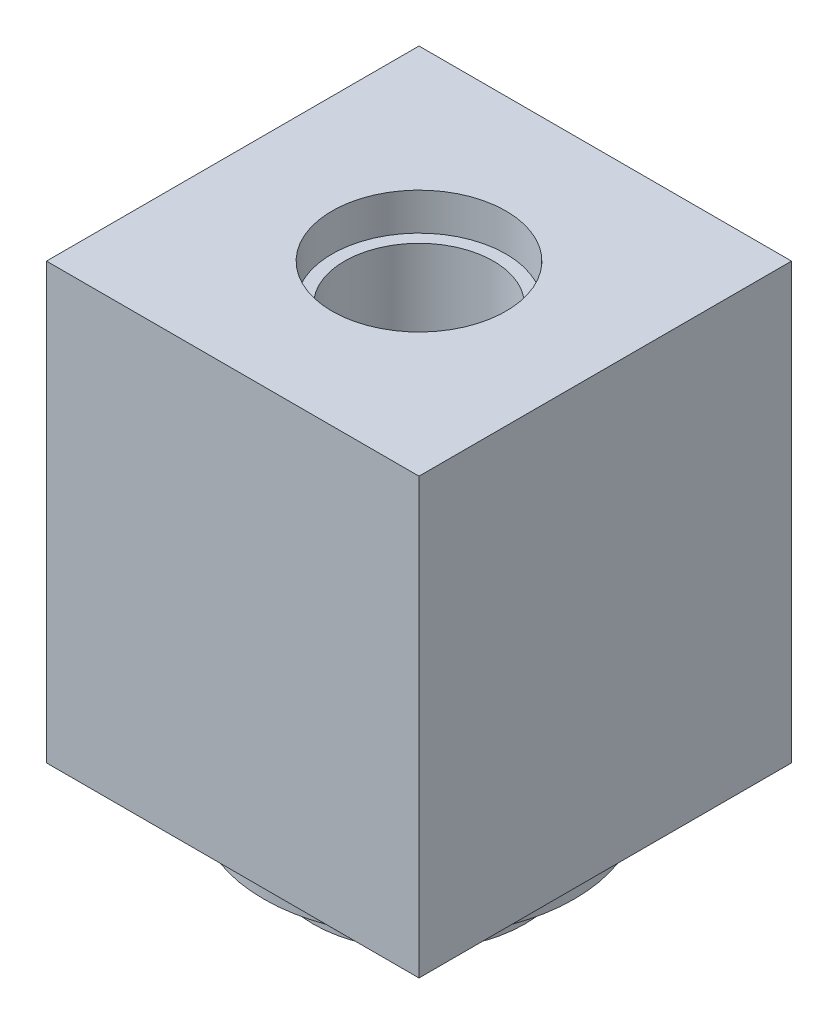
from build123d import *

# Parameters (mm, degrees)
SKICA1_W                     = 30
SKICA1_H                     = 30
P_IDAT_VYSUNUT_M1_DEPTH      = 35
SKICA2_R                     = 12.5
P_IDAT_VYSUNUT_M2_DEPTH      = 7
SKICA3_OUTSIDE_W             = 43.94
SKICA3_OUTSIDE_H             = 43.94
SKICA3_OUTSIDE_R             = 8.5
ODEBRAT_VYSUNUT_M1_DEPTH     = 2
ZKOSEN_1_SIZE                = 1.75
ZKOSEN_1_SIZE2               = 3
F_15_0_15_PR_M_R_D_RY1_D     = 15
F_15_0_15_PR_M_R_D_RY1_DEPTH = 7
F_15_0_15_PR_M_R_D_RY1_TIP   = 4.330127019
SKICA6_R                     = 6
ODEBRAT_VYSUNUT_M2_DEPTH     = 48.053161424
SKICA11_R                    = 7
ODEBRAT_VYSUNUT_M4_DEPTH     = 3
F_6_0_6_PR_M_R_D_RY1_D       = 6
F_6_0_6_PR_M_R_D_RY1_DEPTH   = 15
F_6_0_6_PR_M_R_D_RY1_TIP     = 1.732050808
SKICA14_R                    = 7
ODEBRAT_VYSUNUT_M5_DEPTH     = 2
ZKOSEN_2_SIZE                = 1


with BuildPart() as part:
    # Skica1 → P_idat vysunut_m1 (new body)
    with BuildSketch(Plane(origin=(0, 0, 0), x_dir=(1, 0, 0), z_dir=(0, 1, 0))):
        Rectangle(SKICA1_W, SKICA1_H)
    extrude(amount=P_IDAT_VYSUNUT_M1_DEPTH)

    # Skica2 → P_idat vysunut_m2 (add)
    with BuildSketch(Plane.XZ):
        with Locations(Location((0, 0, 0), (0, 0, 90))):
            Circle(SKICA2_R)
    extrude(amount=P_IDAT_VYSUNUT_M2_DEPTH)

    # Skica3 outside → Odebrat vysunut_m1 (cut)
    with BuildSketch(Plane.XZ.offset(7)):
        Rectangle(SKICA3_OUTSIDE_W, SKICA3_OUTSIDE_H)
        with Locations(Location((0, 0, 0), (0, 0, 270))):
            Circle(SKICA3_OUTSIDE_R, mode=Mode.SUBTRACT)
    extrude(amount=-ODEBRAT_VYSUNUT_M1_DEPTH, mode=Mode.SUBTRACT)

    # Zkosen_1
    zkosen_1_edges = [part.edges().sort_by_distance(p)[0] for p in [
        (0, -5, -12.5),
    ]]
    zkosen_1_side = [part.faces().sort_by_distance(p)[0] for p in [
        (0, -2.5, -12.5),
    ]]
    chamfer(zkosen_1_edges, length=ZKOSEN_1_SIZE, length2=ZKOSEN_1_SIZE2, reference=zkosen_1_side[0])

    # 15.0 _15_ pr_m_r d_ry1
    with Locations(Plane.XZ.offset(7)):
        with Locations((0, 0)):
            Hole(F_15_0_15_PR_M_R_D_RY1_D / 2, depth=F_15_0_15_PR_M_R_D_RY1_DEPTH)
            with Locations((0, 0, -(F_15_0_15_PR_M_R_D_RY1_DEPTH + F_15_0_15_PR_M_R_D_RY1_TIP / 2))):  # 120° drill point
                Cone(0, F_15_0_15_PR_M_R_D_RY1_D / 2, F_15_0_15_PR_M_R_D_RY1_TIP, mode=Mode.SUBTRACT)

    # Skica6 → Odebrat vysunut_m2 (cut, through all)
    with BuildSketch(Plane(origin=(0, 35, 0), x_dir=(1, 0, 0), z_dir=(0, 1, 0))):
        with Locations(Location((0, 0, 0), (0, 0, 270))):
            Circle(SKICA6_R)
    extrude(amount=-ODEBRAT_VYSUNUT_M2_DEPTH, mode=Mode.SUBTRACT)

    # Skica11 → Odebrat vysunut_m4 (cut)
    with BuildSketch(Plane(origin=(0, 35, 0), x_dir=(1, 0, 0), z_dir=(0, 1, 0))):
        with Locations(Location((0, 0, 0), (0, 0, 270))):
            Circle(SKICA11_R)
    extrude(amount=-ODEBRAT_VYSUNUT_M4_DEPTH, mode=Mode.SUBTRACT)

    # 6.0 _6_ pr_m_r d_ry1
    with Locations(Plane.ZY.offset(15)):
        with Locations((0, 17.5)):
            Hole(F_6_0_6_PR_M_R_D_RY1_D / 2, depth=F_6_0_6_PR_M_R_D_RY1_DEPTH)
            with Locations((0, 0, -(F_6_0_6_PR_M_R_D_RY1_DEPTH + F_6_0_6_PR_M_R_D_RY1_TIP / 2))):  # 120° drill point
                Cone(0, F_6_0_6_PR_M_R_D_RY1_D / 2, F_6_0_6_PR_M_R_D_RY1_TIP, mode=Mode.SUBTRACT)

    # Skica14 → Odebrat vysunut_m5 (cut)
    with BuildSketch(Plane.ZY.offset(15)):
        with Locations((0, 17.5)):
            Circle(SKICA14_R)
    extrude(amount=-ODEBRAT_VYSUNUT_M5_DEPTH, mode=Mode.SUBTRACT)

    # Zkosen_2
    zkosen_2_edges = [part.edges().sort_by_distance(p)[0] for p in [
        (-13, 17.5, 3),
    ]]
    chamfer(zkosen_2_edges, length=ZKOSEN_2_SIZE)


solid = part.part
